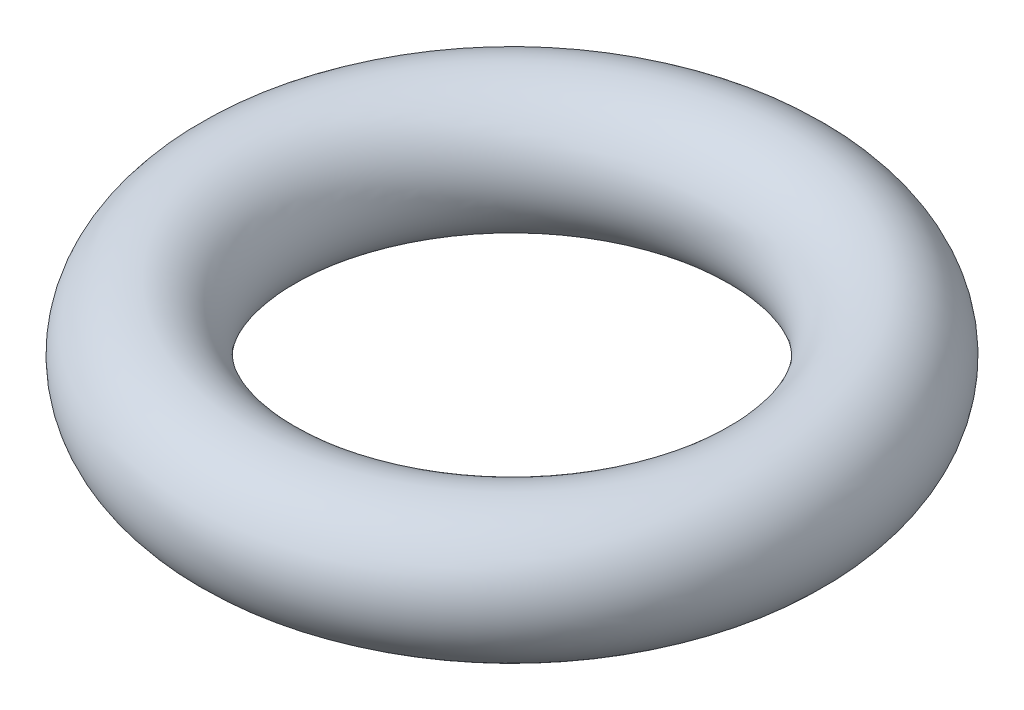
from build123d import *

# Parameters (mm, degrees)
ESQUISSE1_R = 1.2


with BuildPart() as part:
    # Esquisse1 → Base-R_volution (revolve)
    with BuildSketch(Plane.XY, mode=Mode.PRIVATE) as base_r_volution_sk:
        with Locations((-4.8, 0)):
            Circle(ESQUISSE1_R)
    revolve(base_r_volution_sk.sketch.rotate(Axis((0, 40, 0), (0, -1, 0)), 270), axis=Axis((0, 40, 0), (0, -1, 0)))


solid = part.part
